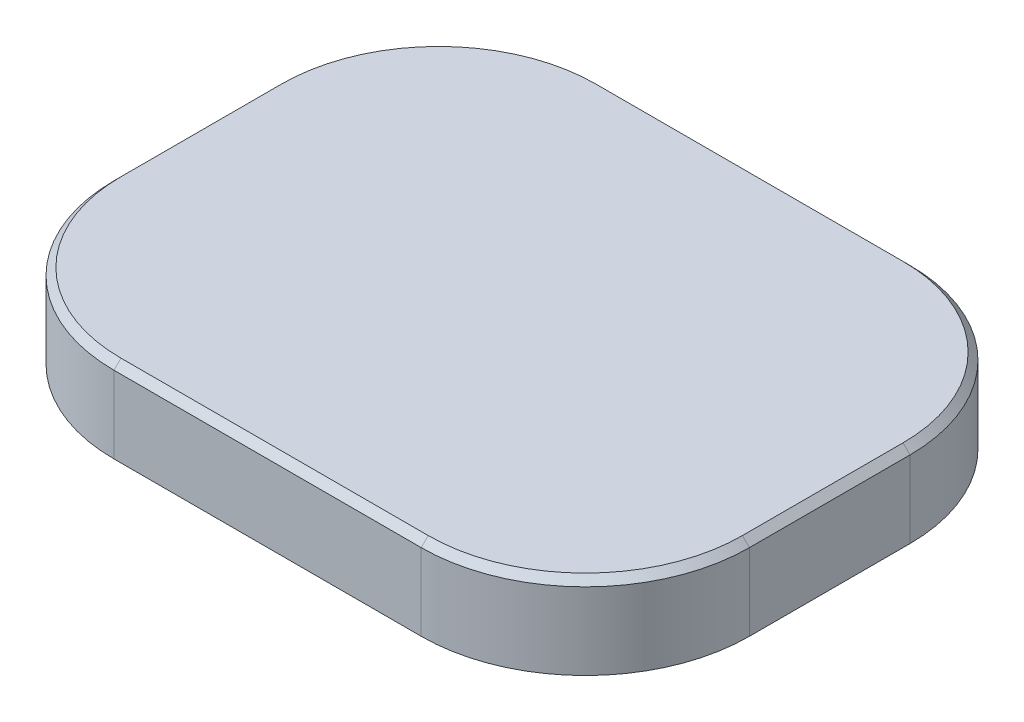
ISO-10303-21;
HEADER;
FILE_DESCRIPTION(('STEP AP214'),'2;1');
FILE_NAME('part.step','',(''),(''),'','','');
FILE_SCHEMA(('AUTOMOTIVE_DESIGN { 1 0 10303 214 1 1 1 1 }'));
ENDSEC;
DATA;
#1=APPLICATION_CONTEXT('core data for automotive mechanical design processes');
#2=APPLICATION_PROTOCOL_DEFINITION('international standard','automotive_design',2000,#1);
#3=PRODUCT_CONTEXT('',#1,'mechanical');
#4=PRODUCT('Part','Part','',(#3));
#5=PRODUCT_RELATED_PRODUCT_CATEGORY('part','',(#4));
#6=PRODUCT_DEFINITION_FORMATION('','',#4);
#7=PRODUCT_DEFINITION_CONTEXT('part definition',#1,'design');
#8=PRODUCT_DEFINITION('design','',#6,#7);
#9=PRODUCT_DEFINITION_SHAPE('','',#8);
#10=(LENGTH_UNIT() NAMED_UNIT(*) SI_UNIT(.MILLI.,.METRE.));
#11=(NAMED_UNIT(*) PLANE_ANGLE_UNIT() SI_UNIT($,.RADIAN.));
#12=(NAMED_UNIT(*) SI_UNIT($,.STERADIAN.) SOLID_ANGLE_UNIT());
#13=UNCERTAINTY_MEASURE_WITH_UNIT(LENGTH_MEASURE(1.E-05),#10,'distance_accuracy_value','');
#14=(GEOMETRIC_REPRESENTATION_CONTEXT(3) GLOBAL_UNCERTAINTY_ASSIGNED_CONTEXT((#13)) GLOBAL_UNIT_ASSIGNED_CONTEXT((#10,
#11,#12)) REPRESENTATION_CONTEXT('',''));
#15=CARTESIAN_POINT('',(0.,0.,0.));
#16=DIRECTION('',(0.,0.,1.));
#17=DIRECTION('',(1.,0.,0.));
#18=AXIS2_PLACEMENT_3D('',#15,#16,#17);
#19=CARTESIAN_POINT('',(0.,30.,0.));
#20=DIRECTION('',(0.,1.,0.));
#21=DIRECTION('',(0.,0.,1.));
#22=AXIS2_PLACEMENT_3D('',#19,#20,#21);
#23=PLANE('',#22);
#24=CARTESIAN_POINT('',(-22.,30.,-11.5));
#25=DIRECTION('',(0.,1.,0.));
#26=DIRECTION('',(0.,0.,1.));
#27=AXIS2_PLACEMENT_3D('',#24,#25,#26);
#28=CIRCLE('',#27,23.5);
#29=CARTESIAN_POINT('',(-22.,30.,-35.));
#30=VERTEX_POINT('',#29);
#31=CARTESIAN_POINT('',(-45.5,30.,-11.5));
#32=VERTEX_POINT('',#31);
#33=EDGE_CURVE('E364',#30,#32,#28,.T.);
#34=ORIENTED_EDGE('',*,*,#33,.F.);
#35=DIRECTION('',(-1.,0.,0.));
#36=VECTOR('',#35,1.);
#37=CARTESIAN_POINT('',(45.5,30.,-35.));
#38=LINE('',#37,#36);
#39=CARTESIAN_POINT('',(22.,30.,-35.));
#40=VERTEX_POINT('',#39);
#41=EDGE_CURVE('E371',#40,#30,#38,.T.);
#42=ORIENTED_EDGE('',*,*,#41,.F.);
#43=CARTESIAN_POINT('',(22.,30.,-11.5));
#44=DIRECTION('',(0.,1.,0.));
#45=DIRECTION('',(0.,0.,1.));
#46=AXIS2_PLACEMENT_3D('',#43,#44,#45);
#47=CIRCLE('',#46,23.5);
#48=CARTESIAN_POINT('',(45.5,30.,-11.5));
#49=VERTEX_POINT('',#48);
#50=EDGE_CURVE('E352',#49,#40,#47,.T.);
#51=ORIENTED_EDGE('',*,*,#50,.F.);
#52=DIRECTION('',(0.,0.,-1.));
#53=VECTOR('',#52,1.);
#54=CARTESIAN_POINT('',(45.5,30.,-35.));
#55=LINE('',#54,#53);
#56=CARTESIAN_POINT('',(45.5,30.,11.5));
#57=VERTEX_POINT('',#56);
#58=EDGE_CURVE('E374',#57,#49,#55,.T.);
#59=ORIENTED_EDGE('',*,*,#58,.F.);
#60=CARTESIAN_POINT('',(22.,30.,11.5));
#61=DIRECTION('',(0.,1.,0.));
#62=DIRECTION('',(0.,0.,1.));
#63=AXIS2_PLACEMENT_3D('',#60,#61,#62);
#64=CIRCLE('',#63,23.5);
#65=CARTESIAN_POINT('',(22.,30.,35.));
#66=VERTEX_POINT('',#65);
#67=EDGE_CURVE('E366',#66,#57,#64,.T.);
#68=ORIENTED_EDGE('',*,*,#67,.F.);
#69=DIRECTION('',(1.,0.,0.));
#70=VECTOR('',#69,1.);
#71=CARTESIAN_POINT('',(45.5,30.,35.));
#72=LINE('',#71,#70);
#73=CARTESIAN_POINT('',(-22.,30.,35.));
#74=VERTEX_POINT('',#73);
#75=EDGE_CURVE('E378',#74,#66,#72,.T.);
#76=ORIENTED_EDGE('',*,*,#75,.F.);
#77=CARTESIAN_POINT('',(-22.,30.,11.5));
#78=DIRECTION('',(0.,1.,0.));
#79=DIRECTION('',(0.,0.,1.));
#80=AXIS2_PLACEMENT_3D('',#77,#78,#79);
#81=CIRCLE('',#80,23.5);
#82=CARTESIAN_POINT('',(-45.5,30.,11.5));
#83=VERTEX_POINT('',#82);
#84=EDGE_CURVE('E368',#83,#74,#81,.T.);
#85=ORIENTED_EDGE('',*,*,#84,.F.);
#86=DIRECTION('',(0.,0.,1.));
#87=VECTOR('',#86,1.);
#88=CARTESIAN_POINT('',(-45.5,30.,-35.));
#89=LINE('',#88,#87);
#90=EDGE_CURVE('E381',#32,#83,#89,.T.);
#91=ORIENTED_EDGE('',*,*,#90,.F.);
#92=EDGE_LOOP('',(#34,#42,#51,#59,#68,#76,#85,#91));
#93=FACE_BOUND('',#92,.T.);
#94=CARTESIAN_POINT('',(22.,30.,11.5));
#95=DIRECTION('',(0.,-1.,0.));
#96=DIRECTION('',(0.,0.,-1.));
#97=AXIS2_PLACEMENT_3D('',#94,#95,#96);
#98=CIRCLE('',#97,19.9);
#99=CARTESIAN_POINT('',(41.9,30.,11.5));
#100=VERTEX_POINT('',#99);
#101=CARTESIAN_POINT('',(22.,30.,31.4));
#102=VERTEX_POINT('',#101);
#103=EDGE_CURVE('E288',#100,#102,#98,.T.);
#104=ORIENTED_EDGE('',*,*,#103,.F.);
#105=DIRECTION('',(0.,0.,1.));
#106=VECTOR('',#105,1.);
#107=CARTESIAN_POINT('',(41.9,30.,-11.5));
#108=LINE('',#107,#106);
#109=CARTESIAN_POINT('',(41.9,30.,-11.5));
#110=VERTEX_POINT('',#109);
#111=EDGE_CURVE('E293',#110,#100,#108,.T.);
#112=ORIENTED_EDGE('',*,*,#111,.F.);
#113=CARTESIAN_POINT('',(22.,30.,-11.5));
#114=DIRECTION('',(0.,-1.,0.));
#115=DIRECTION('',(0.,0.,-1.));
#116=AXIS2_PLACEMENT_3D('',#113,#114,#115);
#117=CIRCLE('',#116,19.9);
#118=CARTESIAN_POINT('',(22.,30.,-31.4));
#119=VERTEX_POINT('',#118);
#120=EDGE_CURVE('E321',#119,#110,#117,.T.);
#121=ORIENTED_EDGE('',*,*,#120,.F.);
#122=DIRECTION('',(1.,0.,0.));
#123=VECTOR('',#122,1.);
#124=CARTESIAN_POINT('',(-22.,30.,-31.4));
#125=LINE('',#124,#123);
#126=CARTESIAN_POINT('',(-22.,30.,-31.4));
#127=VERTEX_POINT('',#126);
#128=EDGE_CURVE('E318',#127,#119,#125,.T.);
#129=ORIENTED_EDGE('',*,*,#128,.F.);
#130=CARTESIAN_POINT('',(-22.,30.,-11.5));
#131=DIRECTION('',(0.,-1.,0.));
#132=DIRECTION('',(0.,0.,-1.));
#133=AXIS2_PLACEMENT_3D('',#130,#131,#132);
#134=CIRCLE('',#133,19.9);
#135=CARTESIAN_POINT('',(-41.9,30.,-11.5));
#136=VERTEX_POINT('',#135);
#137=EDGE_CURVE('E315',#136,#127,#134,.T.);
#138=ORIENTED_EDGE('',*,*,#137,.F.);
#139=DIRECTION('',(0.,0.,-1.));
#140=VECTOR('',#139,1.);
#141=CARTESIAN_POINT('',(-41.9,30.,11.5));
#142=LINE('',#141,#140);
#143=CARTESIAN_POINT('',(-41.9,30.,11.5));
#144=VERTEX_POINT('',#143);
#145=EDGE_CURVE('E312',#144,#136,#142,.T.);
#146=ORIENTED_EDGE('',*,*,#145,.F.);
#147=CARTESIAN_POINT('',(-22.,30.,11.5));
#148=DIRECTION('',(0.,-1.,0.));
#149=DIRECTION('',(0.,0.,-1.));
#150=AXIS2_PLACEMENT_3D('',#147,#148,#149);
#151=CIRCLE('',#150,19.9);
#152=CARTESIAN_POINT('',(-22.,30.,31.4));
#153=VERTEX_POINT('',#152);
#154=EDGE_CURVE('E58',#153,#144,#151,.T.);
#155=ORIENTED_EDGE('',*,*,#154,.F.);
#156=DIRECTION('',(-1.,0.,0.));
#157=VECTOR('',#156,1.);
#158=CARTESIAN_POINT('',(22.,30.,31.4));
#159=LINE('',#158,#157);
#160=EDGE_CURVE('E53',#102,#153,#159,.T.);
#161=ORIENTED_EDGE('',*,*,#160,.F.);
#162=EDGE_LOOP('',(#104,#112,#121,#129,#138,#146,#155,#161));
#163=FACE_BOUND('',#162,.T.);
#164=ADVANCED_FACE('F36',(#93,#163),#23,.F.);
#165=CARTESIAN_POINT('',(45.5,42.,35.));
#166=DIRECTION('',(0.,0.,-1.));
#167=DIRECTION('',(-1.,0.,0.));
#168=AXIS2_PLACEMENT_3D('',#165,#166,#167);
#169=PLANE('',#168);
#170=DIRECTION('',(0.,1.,0.));
#171=VECTOR('',#170,1.);
#172=CARTESIAN_POINT('',(22.,22.,35.));
#173=LINE('',#172,#171);
#174=CARTESIAN_POINT('',(22.,41.,35.));
#175=VERTEX_POINT('',#174);
#176=EDGE_CURVE('E356',#66,#175,#173,.T.);
#177=ORIENTED_EDGE('',*,*,#176,.T.);
#178=DIRECTION('',(-1.,0.,0.));
#179=VECTOR('',#178,1.);
#180=CARTESIAN_POINT('',(45.5,41.,35.));
#181=LINE('',#180,#179);
#182=CARTESIAN_POINT('',(-22.,41.,35.));
#183=VERTEX_POINT('',#182);
#184=EDGE_CURVE('E426',#175,#183,#181,.T.);
#185=ORIENTED_EDGE('',*,*,#184,.T.);
#186=DIRECTION('',(0.,1.,0.));
#187=VECTOR('',#186,1.);
#188=CARTESIAN_POINT('',(-22.,22.,35.));
#189=LINE('',#188,#187);
#190=EDGE_CURVE('E359',#74,#183,#189,.T.);
#191=ORIENTED_EDGE('',*,*,#190,.F.);
#192=ORIENTED_EDGE('',*,*,#75,.T.);
#193=EDGE_LOOP('',(#177,#185,#191,#192));
#194=FACE_BOUND('',#193,.T.);
#195=ADVANCED_FACE('F552',(#194),#169,.F.);
#196=CARTESIAN_POINT('',(0.,42.,0.));
#197=DIRECTION('',(0.,-1.,0.));
#198=DIRECTION('',(0.,0.,-1.));
#199=AXIS2_PLACEMENT_3D('',#196,#197,#198);
#200=PLANE('',#199);
#201=DIRECTION('',(-1.,0.,0.));
#202=VECTOR('',#201,1.);
#203=CARTESIAN_POINT('',(0.,42.,-34.));
#204=LINE('',#203,#202);
#205=CARTESIAN_POINT('',(22.,42.,-34.));
#206=VERTEX_POINT('',#205);
#207=CARTESIAN_POINT('',(-22.,42.,-34.));
#208=VERTEX_POINT('',#207);
#209=EDGE_CURVE('E408',#206,#208,#204,.T.);
#210=ORIENTED_EDGE('',*,*,#209,.T.);
#211=CARTESIAN_POINT('',(-22.,42.,-11.5));
#212=DIRECTION('',(0.,-1.,0.));
#213=DIRECTION('',(0.,0.,-1.));
#214=AXIS2_PLACEMENT_3D('',#211,#212,#213);
#215=CIRCLE('',#214,22.5);
#216=CARTESIAN_POINT('',(-44.5,42.,-11.5));
#217=VERTEX_POINT('',#216);
#218=EDGE_CURVE('E412',#208,#217,#215,.F.);
#219=ORIENTED_EDGE('',*,*,#218,.T.);
#220=DIRECTION('',(0.,0.,1.));
#221=VECTOR('',#220,1.);
#222=CARTESIAN_POINT('',(-44.5,42.,0.));
#223=LINE('',#222,#221);
#224=CARTESIAN_POINT('',(-44.5,42.,11.5));
#225=VERTEX_POINT('',#224);
#226=EDGE_CURVE('E410',#217,#225,#223,.T.);
#227=ORIENTED_EDGE('',*,*,#226,.T.);
#228=CARTESIAN_POINT('',(-22.,42.,11.5));
#229=DIRECTION('',(0.,-1.,0.));
#230=DIRECTION('',(0.,0.,-1.));
#231=AXIS2_PLACEMENT_3D('',#228,#229,#230);
#232=CIRCLE('',#231,22.5);
#233=CARTESIAN_POINT('',(-22.,42.,34.));
#234=VERTEX_POINT('',#233);
#235=EDGE_CURVE('E406',#225,#234,#232,.F.);
#236=ORIENTED_EDGE('',*,*,#235,.T.);
#237=DIRECTION('',(1.,0.,0.));
#238=VECTOR('',#237,1.);
#239=CARTESIAN_POINT('',(0.,42.,34.));
#240=LINE('',#239,#238);
#241=CARTESIAN_POINT('',(22.,42.,34.));
#242=VERTEX_POINT('',#241);
#243=EDGE_CURVE('E402',#234,#242,#240,.T.);
#244=ORIENTED_EDGE('',*,*,#243,.T.);
#245=CARTESIAN_POINT('',(22.,42.,11.5));
#246=DIRECTION('',(0.,-1.,0.));
#247=DIRECTION('',(0.,0.,-1.));
#248=AXIS2_PLACEMENT_3D('',#245,#246,#247);
#249=CIRCLE('',#248,22.5);
#250=CARTESIAN_POINT('',(44.5000000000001,42.,11.5));
#251=VERTEX_POINT('',#250);
#252=EDGE_CURVE('E398',#242,#251,#249,.F.);
#253=ORIENTED_EDGE('',*,*,#252,.T.);
#254=DIRECTION('',(0.,0.,-1.));
#255=VECTOR('',#254,1.);
#256=CARTESIAN_POINT('',(44.5,42.,0.));
#257=LINE('',#256,#255);
#258=CARTESIAN_POINT('',(44.5,42.,-11.5));
#259=VERTEX_POINT('',#258);
#260=EDGE_CURVE('E400',#251,#259,#257,.T.);
#261=ORIENTED_EDGE('',*,*,#260,.T.);
#262=CARTESIAN_POINT('',(22.,42.,-11.5));
#263=DIRECTION('',(0.,-1.,0.));
#264=DIRECTION('',(0.,0.,-1.));
#265=AXIS2_PLACEMENT_3D('',#262,#263,#264);
#266=CIRCLE('',#265,22.5);
#267=EDGE_CURVE('E404',#259,#206,#266,.F.);
#268=ORIENTED_EDGE('',*,*,#267,.T.);
#269=EDGE_LOOP('',(#210,#219,#227,#236,#244,#253,#261,#268));
#270=FACE_BOUND('',#269,.T.);
#271=ADVANCED_FACE('F558',(#270),#200,.F.);
#272=CARTESIAN_POINT('',(-45.5,42.,-35.));
#273=DIRECTION('',(1.,0.,0.));
#274=DIRECTION('',(0.,0.,-1.));
#275=AXIS2_PLACEMENT_3D('',#272,#273,#274);
#276=PLANE('',#275);
#277=DIRECTION('',(0.,1.,0.));
#278=VECTOR('',#277,1.);
#279=CARTESIAN_POINT('',(-45.5,22.,11.5));
#280=LINE('',#279,#278);
#281=CARTESIAN_POINT('',(-45.5,41.,11.5));
#282=VERTEX_POINT('',#281);
#283=EDGE_CURVE('E395',#83,#282,#280,.T.);
#284=ORIENTED_EDGE('',*,*,#283,.T.);
#285=DIRECTION('',(0.,0.,-1.));
#286=VECTOR('',#285,1.);
#287=CARTESIAN_POINT('',(-45.5,41.,-35.));
#288=LINE('',#287,#286);
#289=CARTESIAN_POINT('',(-45.5,41.,-11.5));
#290=VERTEX_POINT('',#289);
#291=EDGE_CURVE('E418',#282,#290,#288,.T.);
#292=ORIENTED_EDGE('',*,*,#291,.T.);
#293=DIRECTION('',(0.,1.,0.));
#294=VECTOR('',#293,1.);
#295=CARTESIAN_POINT('',(-45.5,22.,-11.5));
#296=LINE('',#295,#294);
#297=EDGE_CURVE('E349',#32,#290,#296,.T.);
#298=ORIENTED_EDGE('',*,*,#297,.F.);
#299=ORIENTED_EDGE('',*,*,#90,.T.);
#300=EDGE_LOOP('',(#284,#292,#298,#299));
#301=FACE_BOUND('',#300,.T.);
#302=ADVANCED_FACE('F564',(#301),#276,.F.);
#303=CARTESIAN_POINT('',(45.5,42.,-35.));
#304=DIRECTION('',(-1.,0.,0.));
#305=DIRECTION('',(0.,0.,1.));
#306=AXIS2_PLACEMENT_3D('',#303,#304,#305);
#307=PLANE('',#306);
#308=DIRECTION('',(0.,1.,0.));
#309=VECTOR('',#308,1.);
#310=CARTESIAN_POINT('',(45.5,22.,-11.5));
#311=LINE('',#310,#309);
#312=CARTESIAN_POINT('',(45.5,41.,-11.5));
#313=VERTEX_POINT('',#312);
#314=EDGE_CURVE('E353',#49,#313,#311,.T.);
#315=ORIENTED_EDGE('',*,*,#314,.T.);
#316=DIRECTION('',(0.,0.,1.));
#317=VECTOR('',#316,1.);
#318=CARTESIAN_POINT('',(45.5,41.,-35.));
#319=LINE('',#318,#317);
#320=CARTESIAN_POINT('',(45.5,41.,11.5));
#321=VERTEX_POINT('',#320);
#322=EDGE_CURVE('E45',#313,#321,#319,.T.);
#323=ORIENTED_EDGE('',*,*,#322,.T.);
#324=DIRECTION('',(0.,1.,0.));
#325=VECTOR('',#324,1.);
#326=CARTESIAN_POINT('',(45.5,22.,11.5));
#327=LINE('',#326,#325);
#328=EDGE_CURVE('E392',#57,#321,#327,.T.);
#329=ORIENTED_EDGE('',*,*,#328,.F.);
#330=ORIENTED_EDGE('',*,*,#58,.T.);
#331=EDGE_LOOP('',(#315,#323,#329,#330));
#332=FACE_BOUND('',#331,.T.);
#333=ADVANCED_FACE('F828',(#332),#307,.F.);
#334=CARTESIAN_POINT('',(45.5,42.,-35.));
#335=DIRECTION('',(0.,0.,1.));
#336=DIRECTION('',(1.,0.,0.));
#337=AXIS2_PLACEMENT_3D('',#334,#335,#336);
#338=PLANE('',#337);
#339=DIRECTION('',(0.,1.,0.));
#340=VECTOR('',#339,1.);
#341=CARTESIAN_POINT('',(-22.,22.,-35.));
#342=LINE('',#341,#340);
#343=CARTESIAN_POINT('',(-22.,41.,-35.));
#344=VERTEX_POINT('',#343);
#345=EDGE_CURVE('E388',#30,#344,#342,.T.);
#346=ORIENTED_EDGE('',*,*,#345,.T.);
#347=DIRECTION('',(1.,0.,0.));
#348=VECTOR('',#347,1.);
#349=CARTESIAN_POINT('',(45.5,41.,-35.));
#350=LINE('',#349,#348);
#351=CARTESIAN_POINT('',(22.,41.,-35.));
#352=VERTEX_POINT('',#351);
#353=EDGE_CURVE('E420',#344,#352,#350,.T.);
#354=ORIENTED_EDGE('',*,*,#353,.T.);
#355=DIRECTION('',(0.,1.,0.));
#356=VECTOR('',#355,1.);
#357=CARTESIAN_POINT('',(22.,22.,-35.));
#358=LINE('',#357,#356);
#359=EDGE_CURVE('E385',#40,#352,#358,.T.);
#360=ORIENTED_EDGE('',*,*,#359,.F.);
#361=ORIENTED_EDGE('',*,*,#41,.T.);
#362=EDGE_LOOP('',(#346,#354,#360,#361));
#363=FACE_BOUND('',#362,.T.);
#364=ADVANCED_FACE('F822',(#363),#338,.F.);
#365=CARTESIAN_POINT('',(22.,22.,-11.5));
#366=DIRECTION('',(0.,1.,0.));
#367=DIRECTION('',(0.,0.,1.));
#368=AXIS2_PLACEMENT_3D('',#365,#366,#367);
#369=CYLINDRICAL_SURFACE('',#368,23.5);
#370=ORIENTED_EDGE('',*,*,#359,.T.);
#371=CARTESIAN_POINT('',(22.,41.,-11.5));
#372=DIRECTION('',(0.,-1.,0.));
#373=DIRECTION('',(0.,0.,-1.));
#374=AXIS2_PLACEMENT_3D('',#371,#372,#373);
#375=CIRCLE('',#374,23.5);
#376=EDGE_CURVE('E424',#352,#313,#375,.T.);
#377=ORIENTED_EDGE('',*,*,#376,.T.);
#378=ORIENTED_EDGE('',*,*,#314,.F.);
#379=ORIENTED_EDGE('',*,*,#50,.T.);
#380=EDGE_LOOP('',(#370,#377,#378,#379));
#381=FACE_BOUND('',#380,.T.);
#382=ADVANCED_FACE('F827',(#381),#369,.T.);
#383=CARTESIAN_POINT('',(-22.,22.,-11.5));
#384=DIRECTION('',(0.,1.,0.));
#385=DIRECTION('',(0.,0.,1.));
#386=AXIS2_PLACEMENT_3D('',#383,#384,#385);
#387=CYLINDRICAL_SURFACE('',#386,23.5);
#388=ORIENTED_EDGE('',*,*,#297,.T.);
#389=CARTESIAN_POINT('',(-22.,41.,-11.5));
#390=DIRECTION('',(0.,-1.,0.));
#391=DIRECTION('',(0.,0.,-1.));
#392=AXIS2_PLACEMENT_3D('',#389,#390,#391);
#393=CIRCLE('',#392,23.5);
#394=EDGE_CURVE('E415',#290,#344,#393,.T.);
#395=ORIENTED_EDGE('',*,*,#394,.T.);
#396=ORIENTED_EDGE('',*,*,#345,.F.);
#397=ORIENTED_EDGE('',*,*,#33,.T.);
#398=EDGE_LOOP('',(#388,#395,#396,#397));
#399=FACE_BOUND('',#398,.T.);
#400=ADVANCED_FACE('F859',(#399),#387,.T.);
#401=CARTESIAN_POINT('',(22.,22.,11.5));
#402=DIRECTION('',(0.,1.,0.));
#403=DIRECTION('',(0.,0.,1.));
#404=AXIS2_PLACEMENT_3D('',#401,#402,#403);
#405=CYLINDRICAL_SURFACE('',#404,23.5);
#406=ORIENTED_EDGE('',*,*,#328,.T.);
#407=CARTESIAN_POINT('',(22.,41.,11.5));
#408=DIRECTION('',(0.,-1.,0.));
#409=DIRECTION('',(0.,0.,-1.));
#410=AXIS2_PLACEMENT_3D('',#407,#408,#409);
#411=CIRCLE('',#410,23.5);
#412=EDGE_CURVE('E11',#321,#175,#411,.T.);
#413=ORIENTED_EDGE('',*,*,#412,.T.);
#414=ORIENTED_EDGE('',*,*,#176,.F.);
#415=ORIENTED_EDGE('',*,*,#67,.T.);
#416=EDGE_LOOP('',(#406,#413,#414,#415));
#417=FACE_BOUND('',#416,.T.);
#418=ADVANCED_FACE('F868',(#417),#405,.T.);
#419=CARTESIAN_POINT('',(-22.,22.,11.5));
#420=DIRECTION('',(0.,1.,0.));
#421=DIRECTION('',(0.,0.,1.));
#422=AXIS2_PLACEMENT_3D('',#419,#420,#421);
#423=CYLINDRICAL_SURFACE('',#422,23.5);
#424=ORIENTED_EDGE('',*,*,#190,.T.);
#425=CARTESIAN_POINT('',(-22.,41.,11.5));
#426=DIRECTION('',(0.,-1.,0.));
#427=DIRECTION('',(0.,0.,-1.));
#428=AXIS2_PLACEMENT_3D('',#425,#426,#427);
#429=CIRCLE('',#428,23.5);
#430=EDGE_CURVE('E422',#183,#282,#429,.T.);
#431=ORIENTED_EDGE('',*,*,#430,.T.);
#432=ORIENTED_EDGE('',*,*,#283,.F.);
#433=ORIENTED_EDGE('',*,*,#84,.T.);
#434=EDGE_LOOP('',(#424,#431,#432,#433));
#435=FACE_BOUND('',#434,.T.);
#436=ADVANCED_FACE('F596',(#435),#423,.T.);
#437=CARTESIAN_POINT('',(22.,42.,11.5));
#438=DIRECTION('',(0.,-1.,0.));
#439=DIRECTION('',(0.,0.,-1.));
#440=AXIS2_PLACEMENT_3D('',#437,#438,#439);
#441=CONICAL_SURFACE('',#440,22.5,0.785398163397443);
#442=DIRECTION('',(0.,0.70710678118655,-0.707106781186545));
#443=VECTOR('',#442,1.);
#444=CARTESIAN_POINT('',(22.,41.,35.));
#445=LINE('',#444,#443);
#446=EDGE_CURVE('E444',#175,#242,#445,.T.);
#447=ORIENTED_EDGE('',*,*,#446,.F.);
#448=ORIENTED_EDGE('',*,*,#412,.F.);
#449=DIRECTION('',(0.707106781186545,-0.70710678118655,0.));
#450=VECTOR('',#449,1.);
#451=CARTESIAN_POINT('',(44.5000000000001,42.,11.5));
#452=LINE('',#451,#450);
#453=EDGE_CURVE('E362',#251,#321,#452,.T.);
#454=ORIENTED_EDGE('',*,*,#453,.F.);
#455=ORIENTED_EDGE('',*,*,#252,.F.);
#456=EDGE_LOOP('',(#447,#448,#454,#455));
#457=FACE_BOUND('',#456,.T.);
#458=ADVANCED_FACE('F592',(#457),#441,.T.);
#459=CARTESIAN_POINT('',(44.5,42.,0.));
#460=DIRECTION('',(-0.70710678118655,-0.707106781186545,0.));
#461=DIRECTION('',(0.,0.,-1.));
#462=AXIS2_PLACEMENT_3D('',#459,#460,#461);
#463=PLANE('',#462);
#464=ORIENTED_EDGE('',*,*,#453,.T.);
#465=ORIENTED_EDGE('',*,*,#322,.F.);
#466=DIRECTION('',(0.707106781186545,-0.70710678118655,0.));
#467=VECTOR('',#466,1.);
#468=CARTESIAN_POINT('',(44.5,42.,-11.5));
#469=LINE('',#468,#467);
#470=EDGE_CURVE('E441',#259,#313,#469,.T.);
#471=ORIENTED_EDGE('',*,*,#470,.F.);
#472=ORIENTED_EDGE('',*,*,#260,.F.);
#473=EDGE_LOOP('',(#464,#465,#471,#472));
#474=FACE_BOUND('',#473,.T.);
#475=ADVANCED_FACE('F588',(#474),#463,.F.);
#476=CARTESIAN_POINT('',(0.,42.,34.));
#477=DIRECTION('',(0.,-0.707106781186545,-0.70710678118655));
#478=DIRECTION('',(1.,0.,0.));
#479=AXIS2_PLACEMENT_3D('',#476,#477,#478);
#480=PLANE('',#479);
#481=ORIENTED_EDGE('',*,*,#446,.T.);
#482=ORIENTED_EDGE('',*,*,#243,.F.);
#483=DIRECTION('',(0.,0.707106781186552,-0.707106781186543));
#484=VECTOR('',#483,1.);
#485=CARTESIAN_POINT('',(-22.,41.,35.));
#486=LINE('',#485,#484);
#487=EDGE_CURVE('E438',#183,#234,#486,.T.);
#488=ORIENTED_EDGE('',*,*,#487,.F.);
#489=ORIENTED_EDGE('',*,*,#184,.F.);
#490=EDGE_LOOP('',(#481,#482,#488,#489));
#491=FACE_BOUND('',#490,.T.);
#492=ADVANCED_FACE('F584',(#491),#480,.F.);
#493=CARTESIAN_POINT('',(22.,42.,-11.5));
#494=DIRECTION('',(0.,-1.,0.));
#495=DIRECTION('',(0.,0.,-1.));
#496=AXIS2_PLACEMENT_3D('',#493,#494,#495);
#497=CONICAL_SURFACE('',#496,22.5,0.785398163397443);
#498=ORIENTED_EDGE('',*,*,#470,.T.);
#499=ORIENTED_EDGE('',*,*,#376,.F.);
#500=DIRECTION('',(0.,-0.707106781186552,-0.707106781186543));
#501=VECTOR('',#500,1.);
#502=CARTESIAN_POINT('',(22.,42.,-34.));
#503=LINE('',#502,#501);
#504=EDGE_CURVE('E435',#206,#352,#503,.T.);
#505=ORIENTED_EDGE('',*,*,#504,.F.);
#506=ORIENTED_EDGE('',*,*,#267,.F.);
#507=EDGE_LOOP('',(#498,#499,#505,#506));
#508=FACE_BOUND('',#507,.T.);
#509=ADVANCED_FACE('F580',(#508),#497,.T.);
#510=CARTESIAN_POINT('',(-22.,42.,11.5));
#511=DIRECTION('',(0.,-1.,0.));
#512=DIRECTION('',(0.,0.,-1.));
#513=AXIS2_PLACEMENT_3D('',#510,#511,#512);
#514=CONICAL_SURFACE('',#513,22.5,0.785398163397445);
#515=ORIENTED_EDGE('',*,*,#487,.T.);
#516=ORIENTED_EDGE('',*,*,#235,.F.);
#517=DIRECTION('',(0.707106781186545,0.70710678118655,0.));
#518=VECTOR('',#517,1.);
#519=CARTESIAN_POINT('',(-45.5,41.,11.5));
#520=LINE('',#519,#518);
#521=EDGE_CURVE('E432',#282,#225,#520,.T.);
#522=ORIENTED_EDGE('',*,*,#521,.F.);
#523=ORIENTED_EDGE('',*,*,#430,.F.);
#524=EDGE_LOOP('',(#515,#516,#522,#523));
#525=FACE_BOUND('',#524,.T.);
#526=ADVANCED_FACE('F576',(#525),#514,.T.);
#527=CARTESIAN_POINT('',(0.,42.,-34.));
#528=DIRECTION('',(0.,-0.707106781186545,0.70710678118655));
#529=DIRECTION('',(-1.,0.,0.));
#530=AXIS2_PLACEMENT_3D('',#527,#528,#529);
#531=PLANE('',#530);
#532=ORIENTED_EDGE('',*,*,#504,.T.);
#533=ORIENTED_EDGE('',*,*,#353,.F.);
#534=DIRECTION('',(0.,-0.70710678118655,-0.707106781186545));
#535=VECTOR('',#534,1.);
#536=CARTESIAN_POINT('',(-22.,42.,-34.));
#537=LINE('',#536,#535);
#538=EDGE_CURVE('E430',#208,#344,#537,.T.);
#539=ORIENTED_EDGE('',*,*,#538,.F.);
#540=ORIENTED_EDGE('',*,*,#209,.F.);
#541=EDGE_LOOP('',(#532,#533,#539,#540));
#542=FACE_BOUND('',#541,.T.);
#543=ADVANCED_FACE('F572',(#542),#531,.F.);
#544=CARTESIAN_POINT('',(-44.5,42.,0.));
#545=DIRECTION('',(0.70710678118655,-0.707106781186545,0.));
#546=DIRECTION('',(0.,0.,1.));
#547=AXIS2_PLACEMENT_3D('',#544,#545,#546);
#548=PLANE('',#547);
#549=ORIENTED_EDGE('',*,*,#521,.T.);
#550=ORIENTED_EDGE('',*,*,#226,.F.);
#551=DIRECTION('',(0.707106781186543,0.707106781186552,0.));
#552=VECTOR('',#551,1.);
#553=CARTESIAN_POINT('',(-45.5,41.,-11.5));
#554=LINE('',#553,#552);
#555=EDGE_CURVE('E348',#290,#217,#554,.T.);
#556=ORIENTED_EDGE('',*,*,#555,.F.);
#557=ORIENTED_EDGE('',*,*,#291,.F.);
#558=EDGE_LOOP('',(#549,#550,#556,#557));
#559=FACE_BOUND('',#558,.T.);
#560=ADVANCED_FACE('F568',(#559),#548,.F.);
#561=CARTESIAN_POINT('',(-22.,42.,-11.5));
#562=DIRECTION('',(0.,-1.,0.));
#563=DIRECTION('',(0.,0.,-1.));
#564=AXIS2_PLACEMENT_3D('',#561,#562,#563);
#565=CONICAL_SURFACE('',#564,22.5,0.785398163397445);
#566=ORIENTED_EDGE('',*,*,#538,.T.);
#567=ORIENTED_EDGE('',*,*,#394,.F.);
#568=ORIENTED_EDGE('',*,*,#555,.T.);
#569=ORIENTED_EDGE('',*,*,#218,.F.);
#570=EDGE_LOOP('',(#566,#567,#568,#569));
#571=FACE_BOUND('',#570,.T.);
#572=ADVANCED_FACE('F565',(#571),#565,.T.);
#573=CARTESIAN_POINT('',(22.,29.,11.5));
#574=DIRECTION('',(0.,-1.,0.));
#575=DIRECTION('',(0.,0.,-1.));
#576=AXIS2_PLACEMENT_3D('',#573,#574,#575);
#577=PLANE('',#576);
#578=CARTESIAN_POINT('',(22.,29.,11.5));
#579=DIRECTION('',(0.,-1.,0.));
#580=DIRECTION('',(0.,0.,-1.));
#581=AXIS2_PLACEMENT_3D('',#578,#579,#580);
#582=CIRCLE('',#581,19.9);
#583=CARTESIAN_POINT('',(41.9,29.,11.5));
#584=VERTEX_POINT('',#583);
#585=CARTESIAN_POINT('',(22.,29.,31.4));
#586=VERTEX_POINT('',#585);
#587=EDGE_CURVE('E289',#584,#586,#582,.T.);
#588=ORIENTED_EDGE('',*,*,#587,.T.);
#589=DIRECTION('',(-1.,0.,0.));
#590=VECTOR('',#589,1.);
#591=CARTESIAN_POINT('',(22.,29.,31.4));
#592=LINE('',#591,#590);
#593=CARTESIAN_POINT('',(-22.,29.,31.4));
#594=VERTEX_POINT('',#593);
#595=EDGE_CURVE('E292',#586,#594,#592,.T.);
#596=ORIENTED_EDGE('',*,*,#595,.T.);
#597=CARTESIAN_POINT('',(-22.,29.,11.5));
#598=DIRECTION('',(0.,-1.,0.));
#599=DIRECTION('',(0.,0.,-1.));
#600=AXIS2_PLACEMENT_3D('',#597,#598,#599);
#601=CIRCLE('',#600,19.9);
#602=CARTESIAN_POINT('',(-41.9,29.,11.5));
#603=VERTEX_POINT('',#602);
#604=EDGE_CURVE('E295',#594,#603,#601,.T.);
#605=ORIENTED_EDGE('',*,*,#604,.T.);
#606=DIRECTION('',(0.,0.,-1.));
#607=VECTOR('',#606,1.);
#608=CARTESIAN_POINT('',(-41.9,29.,11.5));
#609=LINE('',#608,#607);
#610=CARTESIAN_POINT('',(-41.9,29.,-11.5));
#611=VERTEX_POINT('',#610);
#612=EDGE_CURVE('E297',#603,#611,#609,.T.);
#613=ORIENTED_EDGE('',*,*,#612,.T.);
#614=CARTESIAN_POINT('',(-22.,29.,-11.5));
#615=DIRECTION('',(0.,-1.,0.));
#616=DIRECTION('',(0.,0.,-1.));
#617=AXIS2_PLACEMENT_3D('',#614,#615,#616);
#618=CIRCLE('',#617,19.9);
#619=CARTESIAN_POINT('',(-22.,29.,-31.4));
#620=VERTEX_POINT('',#619);
#621=EDGE_CURVE('E299',#611,#620,#618,.T.);
#622=ORIENTED_EDGE('',*,*,#621,.T.);
#623=DIRECTION('',(1.,0.,0.));
#624=VECTOR('',#623,1.);
#625=CARTESIAN_POINT('',(-22.,29.,-31.4));
#626=LINE('',#625,#624);
#627=CARTESIAN_POINT('',(22.,29.,-31.4));
#628=VERTEX_POINT('',#627);
#629=EDGE_CURVE('E301',#620,#628,#626,.T.);
#630=ORIENTED_EDGE('',*,*,#629,.T.);
#631=CARTESIAN_POINT('',(22.,29.,-11.5));
#632=DIRECTION('',(0.,-1.,0.));
#633=DIRECTION('',(0.,0.,-1.));
#634=AXIS2_PLACEMENT_3D('',#631,#632,#633);
#635=CIRCLE('',#634,19.9);
#636=CARTESIAN_POINT('',(41.9,29.,-11.5));
#637=VERTEX_POINT('',#636);
#638=EDGE_CURVE('E303',#628,#637,#635,.T.);
#639=ORIENTED_EDGE('',*,*,#638,.T.);
#640=DIRECTION('',(0.,0.,1.));
#641=VECTOR('',#640,1.);
#642=CARTESIAN_POINT('',(41.9,29.,-11.5));
#643=LINE('',#642,#641);
#644=EDGE_CURVE('E305',#637,#584,#643,.T.);
#645=ORIENTED_EDGE('',*,*,#644,.T.);
#646=EDGE_LOOP('',(#588,#596,#605,#613,#622,#630,#639,#645));
#647=FACE_BOUND('',#646,.T.);
#648=DIRECTION('',(0.,0.,-1.));
#649=VECTOR('',#648,1.);
#650=CARTESIAN_POINT('',(-41.3,29.,11.5));
#651=LINE('',#650,#649);
#652=CARTESIAN_POINT('',(-41.3,29.,11.5));
#653=VERTEX_POINT('',#652);
#654=CARTESIAN_POINT('',(-41.3,29.,-11.5));
#655=VERTEX_POINT('',#654);
#656=EDGE_CURVE('E249',#653,#655,#651,.T.);
#657=ORIENTED_EDGE('',*,*,#656,.F.);
#658=CARTESIAN_POINT('',(-22.,29.,11.5));
#659=DIRECTION('',(0.,-1.,0.));
#660=DIRECTION('',(0.,0.,-1.));
#661=AXIS2_PLACEMENT_3D('',#658,#659,#660);
#662=CIRCLE('',#661,19.3);
#663=CARTESIAN_POINT('',(-22.,29.,30.8));
#664=VERTEX_POINT('',#663);
#665=EDGE_CURVE('E259',#664,#653,#662,.T.);
#666=ORIENTED_EDGE('',*,*,#665,.F.);
#667=DIRECTION('',(-1.,0.,0.));
#668=VECTOR('',#667,1.);
#669=CARTESIAN_POINT('',(22.,29.,30.8));
#670=LINE('',#669,#668);
#671=CARTESIAN_POINT('',(22.,29.,30.8));
#672=VERTEX_POINT('',#671);
#673=EDGE_CURVE('E286',#672,#664,#670,.T.);
#674=ORIENTED_EDGE('',*,*,#673,.F.);
#675=CARTESIAN_POINT('',(22.,29.,11.5));
#676=DIRECTION('',(0.,-1.,0.));
#677=DIRECTION('',(0.,0.,-1.));
#678=AXIS2_PLACEMENT_3D('',#675,#676,#677);
#679=CIRCLE('',#678,19.3);
#680=CARTESIAN_POINT('',(41.3,29.,11.5));
#681=VERTEX_POINT('',#680);
#682=EDGE_CURVE('E283',#681,#672,#679,.T.);
#683=ORIENTED_EDGE('',*,*,#682,.F.);
#684=DIRECTION('',(0.,0.,1.));
#685=VECTOR('',#684,1.);
#686=CARTESIAN_POINT('',(41.3,29.,-11.5));
#687=LINE('',#686,#685);
#688=CARTESIAN_POINT('',(41.3,29.,-11.5));
#689=VERTEX_POINT('',#688);
#690=EDGE_CURVE('E280',#689,#681,#687,.T.);
#691=ORIENTED_EDGE('',*,*,#690,.F.);
#692=CARTESIAN_POINT('',(22.,29.,-11.5));
#693=DIRECTION('',(0.,-1.,0.));
#694=DIRECTION('',(0.,0.,-1.));
#695=AXIS2_PLACEMENT_3D('',#692,#693,#694);
#696=CIRCLE('',#695,19.3);
#697=CARTESIAN_POINT('',(22.,29.,-30.8));
#698=VERTEX_POINT('',#697);
#699=EDGE_CURVE('E277',#698,#689,#696,.T.);
#700=ORIENTED_EDGE('',*,*,#699,.F.);
#701=DIRECTION('',(1.,0.,0.));
#702=VECTOR('',#701,1.);
#703=CARTESIAN_POINT('',(-22.,29.,-30.8));
#704=LINE('',#703,#702);
#705=CARTESIAN_POINT('',(-22.,29.,-30.8));
#706=VERTEX_POINT('',#705);
#707=EDGE_CURVE('E272',#706,#698,#704,.T.);
#708=ORIENTED_EDGE('',*,*,#707,.F.);
#709=CARTESIAN_POINT('',(-22.,29.,-11.5));
#710=DIRECTION('',(0.,-1.,0.));
#711=DIRECTION('',(0.,0.,-1.));
#712=AXIS2_PLACEMENT_3D('',#709,#710,#711);
#713=CIRCLE('',#712,19.3);
#714=EDGE_CURVE('E270',#655,#706,#713,.T.);
#715=ORIENTED_EDGE('',*,*,#714,.F.);
#716=EDGE_LOOP('',(#657,#666,#674,#683,#691,#700,#708,#715));
#717=FACE_BOUND('',#716,.T.);
#718=ADVANCED_FACE('F267',(#647,#717),#577,.T.);
#719=CARTESIAN_POINT('',(22.,29.,11.5));
#720=DIRECTION('',(0.,1.,0.));
#721=DIRECTION('',(0.,0.,1.));
#722=AXIS2_PLACEMENT_3D('',#719,#720,#721);
#723=CYLINDRICAL_SURFACE('',#722,19.9);
#724=ORIENTED_EDGE('',*,*,#103,.T.);
#725=DIRECTION('',(0.,1.,0.));
#726=VECTOR('',#725,1.);
#727=CARTESIAN_POINT('',(22.,29.,31.4));
#728=LINE('',#727,#726);
#729=EDGE_CURVE('E346',#586,#102,#728,.T.);
#730=ORIENTED_EDGE('',*,*,#729,.F.);
#731=ORIENTED_EDGE('',*,*,#587,.F.);
#732=DIRECTION('',(0.,1.,0.));
#733=VECTOR('',#732,1.);
#734=CARTESIAN_POINT('',(41.9,29.,11.5));
#735=LINE('',#734,#733);
#736=EDGE_CURVE('E307',#584,#100,#735,.T.);
#737=ORIENTED_EDGE('',*,*,#736,.T.);
#738=EDGE_LOOP('',(#724,#730,#731,#737));
#739=FACE_BOUND('',#738,.T.);
#740=ADVANCED_FACE('F891',(#739),#723,.T.);
#741=CARTESIAN_POINT('',(22.,29.,31.4));
#742=DIRECTION('',(0.,0.,-1.));
#743=DIRECTION('',(-1.,0.,0.));
#744=AXIS2_PLACEMENT_3D('',#741,#742,#743);
#745=PLANE('',#744);
#746=ORIENTED_EDGE('',*,*,#160,.T.);
#747=DIRECTION('',(0.,1.,0.));
#748=VECTOR('',#747,1.);
#749=CARTESIAN_POINT('',(-22.,29.,31.4));
#750=LINE('',#749,#748);
#751=EDGE_CURVE('E343',#594,#153,#750,.T.);
#752=ORIENTED_EDGE('',*,*,#751,.F.);
#753=ORIENTED_EDGE('',*,*,#595,.F.);
#754=ORIENTED_EDGE('',*,*,#729,.T.);
#755=EDGE_LOOP('',(#746,#752,#753,#754));
#756=FACE_BOUND('',#755,.T.);
#757=ADVANCED_FACE('F900',(#756),#745,.F.);
#758=CARTESIAN_POINT('',(-22.,29.,11.5));
#759=DIRECTION('',(0.,1.,0.));
#760=DIRECTION('',(0.,0.,1.));
#761=AXIS2_PLACEMENT_3D('',#758,#759,#760);
#762=CYLINDRICAL_SURFACE('',#761,19.9);
#763=ORIENTED_EDGE('',*,*,#154,.T.);
#764=DIRECTION('',(0.,1.,0.));
#765=VECTOR('',#764,1.);
#766=CARTESIAN_POINT('',(-41.9,29.,11.5));
#767=LINE('',#766,#765);
#768=EDGE_CURVE('E340',#603,#144,#767,.T.);
#769=ORIENTED_EDGE('',*,*,#768,.F.);
#770=ORIENTED_EDGE('',*,*,#604,.F.);
#771=ORIENTED_EDGE('',*,*,#751,.T.);
#772=EDGE_LOOP('',(#763,#769,#770,#771));
#773=FACE_BOUND('',#772,.T.);
#774=ADVANCED_FACE('F909',(#773),#762,.T.);
#775=CARTESIAN_POINT('',(-41.9,29.,11.5));
#776=DIRECTION('',(1.,0.,0.));
#777=DIRECTION('',(0.,0.,-1.));
#778=AXIS2_PLACEMENT_3D('',#775,#776,#777);
#779=PLANE('',#778);
#780=ORIENTED_EDGE('',*,*,#145,.T.);
#781=DIRECTION('',(0.,1.,0.));
#782=VECTOR('',#781,1.);
#783=CARTESIAN_POINT('',(-41.9,29.,-11.5));
#784=LINE('',#783,#782);
#785=EDGE_CURVE('E337',#611,#136,#784,.T.);
#786=ORIENTED_EDGE('',*,*,#785,.F.);
#787=ORIENTED_EDGE('',*,*,#612,.F.);
#788=ORIENTED_EDGE('',*,*,#768,.T.);
#789=EDGE_LOOP('',(#780,#786,#787,#788));
#790=FACE_BOUND('',#789,.T.);
#791=ADVANCED_FACE('F918',(#790),#779,.F.);
#792=CARTESIAN_POINT('',(-22.,29.,-11.5));
#793=DIRECTION('',(0.,1.,0.));
#794=DIRECTION('',(0.,0.,1.));
#795=AXIS2_PLACEMENT_3D('',#792,#793,#794);
#796=CYLINDRICAL_SURFACE('',#795,19.9);
#797=ORIENTED_EDGE('',*,*,#137,.T.);
#798=DIRECTION('',(0.,1.,0.));
#799=VECTOR('',#798,1.);
#800=CARTESIAN_POINT('',(-22.,29.,-31.4));
#801=LINE('',#800,#799);
#802=EDGE_CURVE('E334',#620,#127,#801,.T.);
#803=ORIENTED_EDGE('',*,*,#802,.F.);
#804=ORIENTED_EDGE('',*,*,#621,.F.);
#805=ORIENTED_EDGE('',*,*,#785,.T.);
#806=EDGE_LOOP('',(#797,#803,#804,#805));
#807=FACE_BOUND('',#806,.T.);
#808=ADVANCED_FACE('F927',(#807),#796,.T.);
#809=CARTESIAN_POINT('',(-22.,29.,-31.4));
#810=DIRECTION('',(0.,0.,1.));
#811=DIRECTION('',(1.,0.,0.));
#812=AXIS2_PLACEMENT_3D('',#809,#810,#811);
#813=PLANE('',#812);
#814=ORIENTED_EDGE('',*,*,#128,.T.);
#815=DIRECTION('',(0.,1.,0.));
#816=VECTOR('',#815,1.);
#817=CARTESIAN_POINT('',(22.,29.,-31.4));
#818=LINE('',#817,#816);
#819=EDGE_CURVE('E331',#628,#119,#818,.T.);
#820=ORIENTED_EDGE('',*,*,#819,.F.);
#821=ORIENTED_EDGE('',*,*,#629,.F.);
#822=ORIENTED_EDGE('',*,*,#802,.T.);
#823=EDGE_LOOP('',(#814,#820,#821,#822));
#824=FACE_BOUND('',#823,.T.);
#825=ADVANCED_FACE('F936',(#824),#813,.F.);
#826=CARTESIAN_POINT('',(22.,29.,-11.5));
#827=DIRECTION('',(0.,1.,0.));
#828=DIRECTION('',(0.,0.,1.));
#829=AXIS2_PLACEMENT_3D('',#826,#827,#828);
#830=CYLINDRICAL_SURFACE('',#829,19.9);
#831=ORIENTED_EDGE('',*,*,#120,.T.);
#832=DIRECTION('',(0.,1.,0.));
#833=VECTOR('',#832,1.);
#834=CARTESIAN_POINT('',(41.9,29.,-11.5));
#835=LINE('',#834,#833);
#836=EDGE_CURVE('E328',#637,#110,#835,.T.);
#837=ORIENTED_EDGE('',*,*,#836,.F.);
#838=ORIENTED_EDGE('',*,*,#638,.F.);
#839=ORIENTED_EDGE('',*,*,#819,.T.);
#840=EDGE_LOOP('',(#831,#837,#838,#839));
#841=FACE_BOUND('',#840,.T.);
#842=ADVANCED_FACE('F945',(#841),#830,.T.);
#843=CARTESIAN_POINT('',(41.9,29.,-11.5));
#844=DIRECTION('',(-1.,0.,0.));
#845=DIRECTION('',(0.,0.,1.));
#846=AXIS2_PLACEMENT_3D('',#843,#844,#845);
#847=PLANE('',#846);
#848=ORIENTED_EDGE('',*,*,#111,.T.);
#849=ORIENTED_EDGE('',*,*,#736,.F.);
#850=ORIENTED_EDGE('',*,*,#644,.F.);
#851=ORIENTED_EDGE('',*,*,#836,.T.);
#852=EDGE_LOOP('',(#848,#849,#850,#851));
#853=FACE_BOUND('',#852,.T.);
#854=ADVANCED_FACE('F813',(#853),#847,.F.);
#855=CARTESIAN_POINT('',(0.,37.8,0.));
#856=DIRECTION('',(0.,-1.,0.));
#857=DIRECTION('',(0.,0.,-1.));
#858=AXIS2_PLACEMENT_3D('',#855,#856,#857);
#859=PLANE('',#858);
#860=CARTESIAN_POINT('',(22.,37.8,-11.5));
#861=DIRECTION('',(0.,-1.,0.));
#862=DIRECTION('',(0.,0.,-1.));
#863=AXIS2_PLACEMENT_3D('',#860,#861,#862);
#864=CIRCLE('',#863,14.);
#865=CARTESIAN_POINT('',(22.,37.8,-25.5));
#866=VERTEX_POINT('',#865);
#867=CARTESIAN_POINT('',(36.,37.8,-11.5));
#868=VERTEX_POINT('',#867);
#869=EDGE_CURVE('E470',#866,#868,#864,.T.);
#870=ORIENTED_EDGE('',*,*,#869,.T.);
#871=DIRECTION('',(0.,0.,-1.));
#872=VECTOR('',#871,1.);
#873=CARTESIAN_POINT('',(36.,37.8,0.));
#874=LINE('',#873,#872);
#875=CARTESIAN_POINT('',(36.,37.8,11.5));
#876=VERTEX_POINT('',#875);
#877=EDGE_CURVE('E474',#868,#876,#874,.F.);
#878=ORIENTED_EDGE('',*,*,#877,.T.);
#879=CARTESIAN_POINT('',(22.,37.8,11.5));
#880=DIRECTION('',(0.,-1.,0.));
#881=DIRECTION('',(0.,0.,-1.));
#882=AXIS2_PLACEMENT_3D('',#879,#880,#881);
#883=CIRCLE('',#882,14.);
#884=CARTESIAN_POINT('',(22.,37.8,25.5));
#885=VERTEX_POINT('',#884);
#886=EDGE_CURVE('E481',#876,#885,#883,.T.);
#887=ORIENTED_EDGE('',*,*,#886,.T.);
#888=DIRECTION('',(1.,0.,0.));
#889=VECTOR('',#888,1.);
#890=CARTESIAN_POINT('',(0.,37.8,25.5));
#891=LINE('',#890,#889);
#892=CARTESIAN_POINT('',(-22.,37.8,25.5));
#893=VERTEX_POINT('',#892);
#894=EDGE_CURVE('E491',#885,#893,#891,.F.);
#895=ORIENTED_EDGE('',*,*,#894,.T.);
#896=CARTESIAN_POINT('',(-22.,37.8,11.5));
#897=DIRECTION('',(0.,-1.,0.));
#898=DIRECTION('',(0.,0.,-1.));
#899=AXIS2_PLACEMENT_3D('',#896,#897,#898);
#900=CIRCLE('',#899,14.);
#901=CARTESIAN_POINT('',(-36.,37.8,11.5));
#902=VERTEX_POINT('',#901);
#903=EDGE_CURVE('E498',#893,#902,#900,.T.);
#904=ORIENTED_EDGE('',*,*,#903,.T.);
#905=DIRECTION('',(0.,0.,-1.));
#906=VECTOR('',#905,1.);
#907=CARTESIAN_POINT('',(-36.,37.8,0.));
#908=LINE('',#907,#906);
#909=CARTESIAN_POINT('',(-36.,37.8,-11.5));
#910=VERTEX_POINT('',#909);
#911=EDGE_CURVE('E500',#902,#910,#908,.T.);
#912=ORIENTED_EDGE('',*,*,#911,.T.);
#913=CARTESIAN_POINT('',(-22.,37.8,-11.5));
#914=DIRECTION('',(0.,-1.,0.));
#915=DIRECTION('',(0.,0.,-1.));
#916=AXIS2_PLACEMENT_3D('',#913,#914,#915);
#917=CIRCLE('',#916,14.);
#918=CARTESIAN_POINT('',(-22.,37.8,-25.5));
#919=VERTEX_POINT('',#918);
#920=EDGE_CURVE('E471',#910,#919,#917,.T.);
#921=ORIENTED_EDGE('',*,*,#920,.T.);
#922=DIRECTION('',(1.,0.,0.));
#923=VECTOR('',#922,1.);
#924=CARTESIAN_POINT('',(0.,37.8,-25.5));
#925=LINE('',#924,#923);
#926=EDGE_CURVE('E468',#919,#866,#925,.T.);
#927=ORIENTED_EDGE('',*,*,#926,.T.);
#928=EDGE_LOOP('',(#870,#878,#887,#895,#904,#912,#921,#927));
#929=FACE_BOUND('',#928,.T.);
#930=ADVANCED_FACE('F519',(#929),#859,.T.);
#931=CARTESIAN_POINT('',(45.5,32.5,25.5));
#932=DIRECTION('',(-1.,0.,0.));
#933=DIRECTION('',(0.,0.,1.));
#934=AXIS2_PLACEMENT_3D('',#931,#932,#933);
#935=CYLINDRICAL_SURFACE('',#934,5.3);
#936=CARTESIAN_POINT('',(-22.,32.5,25.5));
#937=DIRECTION('',(-1.,0.,0.));
#938=DIRECTION('',(0.,0.,1.));
#939=AXIS2_PLACEMENT_3D('',#936,#937,#938);
#940=CIRCLE('',#939,5.3);
#941=CARTESIAN_POINT('',(-22.,32.5,30.8));
#942=VERTEX_POINT('',#941);
#943=EDGE_CURVE('E462',#942,#893,#940,.T.);
#944=ORIENTED_EDGE('',*,*,#943,.T.);
#945=ORIENTED_EDGE('',*,*,#894,.F.);
#946=CARTESIAN_POINT('',(22.,32.5,25.5));
#947=DIRECTION('',(1.,0.,0.));
#948=DIRECTION('',(0.,0.,-1.));
#949=AXIS2_PLACEMENT_3D('',#946,#947,#948);
#950=CIRCLE('',#949,5.3);
#951=CARTESIAN_POINT('',(22.,32.5,30.8));
#952=VERTEX_POINT('',#951);
#953=EDGE_CURVE('E463',#952,#885,#950,.F.);
#954=ORIENTED_EDGE('',*,*,#953,.F.);
#955=DIRECTION('',(-1.,0.,0.));
#956=VECTOR('',#955,1.);
#957=CARTESIAN_POINT('',(45.5,32.5,30.8));
#958=LINE('',#957,#956);
#959=EDGE_CURVE('E487',#942,#952,#958,.F.);
#960=ORIENTED_EDGE('',*,*,#959,.F.);
#961=EDGE_LOOP('',(#944,#945,#954,#960));
#962=FACE_BOUND('',#961,.T.);
#963=ADVANCED_FACE('F525',(#962),#935,.F.);
#964=CARTESIAN_POINT('',(36.,32.5,-35.));
#965=DIRECTION('',(0.,0.,1.));
#966=DIRECTION('',(1.,0.,0.));
#967=AXIS2_PLACEMENT_3D('',#964,#965,#966);
#968=CYLINDRICAL_SURFACE('',#967,5.3);
#969=CARTESIAN_POINT('',(36.,32.5,11.5));
#970=DIRECTION('',(0.,0.,1.));
#971=DIRECTION('',(1.,0.,0.));
#972=AXIS2_PLACEMENT_3D('',#969,#970,#971);
#973=CIRCLE('',#972,5.3);
#974=CARTESIAN_POINT('',(41.3,32.5,11.5));
#975=VERTEX_POINT('',#974);
#976=EDGE_CURVE('E467',#975,#876,#973,.T.);
#977=ORIENTED_EDGE('',*,*,#976,.T.);
#978=ORIENTED_EDGE('',*,*,#877,.F.);
#979=CARTESIAN_POINT('',(36.,32.5,-11.5));
#980=DIRECTION('',(0.,0.,1.));
#981=DIRECTION('',(1.,0.,0.));
#982=AXIS2_PLACEMENT_3D('',#979,#980,#981);
#983=CIRCLE('',#982,5.3);
#984=CARTESIAN_POINT('',(41.3,32.5,-11.5));
#985=VERTEX_POINT('',#984);
#986=EDGE_CURVE('E370',#868,#985,#983,.F.);
#987=ORIENTED_EDGE('',*,*,#986,.T.);
#988=DIRECTION('',(0.,0.,1.));
#989=VECTOR('',#988,1.);
#990=CARTESIAN_POINT('',(41.3,32.5,-35.));
#991=LINE('',#990,#989);
#992=EDGE_CURVE('E384',#975,#985,#991,.F.);
#993=ORIENTED_EDGE('',*,*,#992,.F.);
#994=EDGE_LOOP('',(#977,#978,#987,#993));
#995=FACE_BOUND('',#994,.T.);
#996=ADVANCED_FACE('F614',(#995),#968,.F.);
#997=CARTESIAN_POINT('',(22.,32.5,11.5));
#998=DIRECTION('',(0.,-1.,0.));
#999=DIRECTION('',(0.,0.,-1.));
#1000=AXIS2_PLACEMENT_3D('',#997,#998,#999);
#1001=TOROIDAL_SURFACE('',#1000,14.,5.3);
#1002=ORIENTED_EDGE('',*,*,#953,.T.);
#1003=ORIENTED_EDGE('',*,*,#886,.F.);
#1004=ORIENTED_EDGE('',*,*,#976,.F.);
#1005=CARTESIAN_POINT('',(22.,32.5,11.5));
#1006=DIRECTION('',(0.,1.,0.));
#1007=DIRECTION('',(0.,0.,1.));
#1008=AXIS2_PLACEMENT_3D('',#1005,#1006,#1007);
#1009=CIRCLE('',#1008,19.3);
#1010=EDGE_CURVE('E389',#952,#975,#1009,.T.);
#1011=ORIENTED_EDGE('',*,*,#1010,.F.);
#1012=EDGE_LOOP('',(#1002,#1003,#1004,#1011));
#1013=FACE_BOUND('',#1012,.T.);
#1014=ADVANCED_FACE('F529',(#1013),#1001,.F.);
#1015=CARTESIAN_POINT('',(45.5,32.5,-25.5));
#1016=DIRECTION('',(1.,0.,0.));
#1017=DIRECTION('',(0.,0.,-1.));
#1018=AXIS2_PLACEMENT_3D('',#1015,#1016,#1017);
#1019=CYLINDRICAL_SURFACE('',#1018,5.3);
#1020=CARTESIAN_POINT('',(-22.,32.5,-25.5));
#1021=DIRECTION('',(1.,0.,0.));
#1022=DIRECTION('',(0.,0.,-1.));
#1023=AXIS2_PLACEMENT_3D('',#1020,#1021,#1022);
#1024=CIRCLE('',#1023,5.3);
#1025=CARTESIAN_POINT('',(-22.,32.5,-30.8));
#1026=VERTEX_POINT('',#1025);
#1027=EDGE_CURVE('E459',#919,#1026,#1024,.F.);
#1028=ORIENTED_EDGE('',*,*,#1027,.T.);
#1029=DIRECTION('',(1.,0.,0.));
#1030=VECTOR('',#1029,1.);
#1031=CARTESIAN_POINT('',(45.5,32.5,-30.8));
#1032=LINE('',#1031,#1030);
#1033=CARTESIAN_POINT('',(22.,32.5,-30.8));
#1034=VERTEX_POINT('',#1033);
#1035=EDGE_CURVE('E453',#1034,#1026,#1032,.F.);
#1036=ORIENTED_EDGE('',*,*,#1035,.F.);
#1037=CARTESIAN_POINT('',(22.,32.5,-25.5));
#1038=DIRECTION('',(-1.,0.,0.));
#1039=DIRECTION('',(0.,0.,1.));
#1040=AXIS2_PLACEMENT_3D('',#1037,#1038,#1039);
#1041=CIRCLE('',#1040,5.3);
#1042=EDGE_CURVE('E464',#866,#1034,#1041,.T.);
#1043=ORIENTED_EDGE('',*,*,#1042,.F.);
#1044=ORIENTED_EDGE('',*,*,#926,.F.);
#1045=EDGE_LOOP('',(#1028,#1036,#1043,#1044));
#1046=FACE_BOUND('',#1045,.T.);
#1047=ADVANCED_FACE('F603',(#1046),#1019,.F.);
#1048=CARTESIAN_POINT('',(22.,32.5,-11.5));
#1049=DIRECTION('',(0.,-1.,0.));
#1050=DIRECTION('',(0.,0.,-1.));
#1051=AXIS2_PLACEMENT_3D('',#1048,#1049,#1050);
#1052=TOROIDAL_SURFACE('',#1051,14.,5.3);
#1053=ORIENTED_EDGE('',*,*,#1042,.T.);
#1054=CARTESIAN_POINT('',(22.,32.5,-11.5));
#1055=DIRECTION('',(0.,1.,0.));
#1056=DIRECTION('',(0.,0.,1.));
#1057=AXIS2_PLACEMENT_3D('',#1054,#1055,#1056);
#1058=CIRCLE('',#1057,19.3);
#1059=EDGE_CURVE('E456',#985,#1034,#1058,.T.);
#1060=ORIENTED_EDGE('',*,*,#1059,.F.);
#1061=ORIENTED_EDGE('',*,*,#986,.F.);
#1062=ORIENTED_EDGE('',*,*,#869,.F.);
#1063=EDGE_LOOP('',(#1053,#1060,#1061,#1062));
#1064=FACE_BOUND('',#1063,.T.);
#1065=ADVANCED_FACE('F606',(#1064),#1052,.F.);
#1066=CARTESIAN_POINT('',(-36.,32.5,-35.));
#1067=DIRECTION('',(0.,0.,-1.));
#1068=DIRECTION('',(-1.,0.,0.));
#1069=AXIS2_PLACEMENT_3D('',#1066,#1067,#1068);
#1070=CYLINDRICAL_SURFACE('',#1069,5.3);
#1071=CARTESIAN_POINT('',(-36.,32.5,-11.5));
#1072=DIRECTION('',(0.,0.,1.));
#1073=DIRECTION('',(1.,0.,0.));
#1074=AXIS2_PLACEMENT_3D('',#1071,#1072,#1073);
#1075=CIRCLE('',#1074,5.3);
#1076=CARTESIAN_POINT('',(-41.3,32.5,-11.5));
#1077=VERTEX_POINT('',#1076);
#1078=EDGE_CURVE('E496',#910,#1077,#1075,.T.);
#1079=ORIENTED_EDGE('',*,*,#1078,.F.);
#1080=ORIENTED_EDGE('',*,*,#911,.F.);
#1081=CARTESIAN_POINT('',(-36.,32.5,11.5));
#1082=DIRECTION('',(0.,0.,1.));
#1083=DIRECTION('',(1.,0.,0.));
#1084=AXIS2_PLACEMENT_3D('',#1081,#1082,#1083);
#1085=CIRCLE('',#1084,5.3);
#1086=CARTESIAN_POINT('',(-41.3,32.5,11.5));
#1087=VERTEX_POINT('',#1086);
#1088=EDGE_CURVE('E505',#1087,#902,#1085,.F.);
#1089=ORIENTED_EDGE('',*,*,#1088,.F.);
#1090=DIRECTION('',(0.,0.,-1.));
#1091=VECTOR('',#1090,1.);
#1092=CARTESIAN_POINT('',(-41.3,32.5,-35.));
#1093=LINE('',#1092,#1091);
#1094=EDGE_CURVE('E252',#1077,#1087,#1093,.F.);
#1095=ORIENTED_EDGE('',*,*,#1094,.F.);
#1096=EDGE_LOOP('',(#1079,#1080,#1089,#1095));
#1097=FACE_BOUND('',#1096,.T.);
#1098=ADVANCED_FACE('F516',(#1097),#1070,.F.);
#1099=CARTESIAN_POINT('',(-22.,32.5,-11.5));
#1100=DIRECTION('',(0.,-1.,0.));
#1101=DIRECTION('',(0.,0.,-1.));
#1102=AXIS2_PLACEMENT_3D('',#1099,#1100,#1101);
#1103=TOROIDAL_SURFACE('',#1102,14.,5.3);
#1104=ORIENTED_EDGE('',*,*,#1078,.T.);
#1105=CARTESIAN_POINT('',(-22.,32.5,-11.5));
#1106=DIRECTION('',(0.,1.,0.));
#1107=DIRECTION('',(0.,0.,1.));
#1108=AXIS2_PLACEMENT_3D('',#1105,#1106,#1107);
#1109=CIRCLE('',#1108,19.3);
#1110=EDGE_CURVE('E455',#1026,#1077,#1109,.T.);
#1111=ORIENTED_EDGE('',*,*,#1110,.F.);
#1112=ORIENTED_EDGE('',*,*,#1027,.F.);
#1113=ORIENTED_EDGE('',*,*,#920,.F.);
#1114=EDGE_LOOP('',(#1104,#1111,#1112,#1113));
#1115=FACE_BOUND('',#1114,.T.);
#1116=ADVANCED_FACE('F642',(#1115),#1103,.F.);
#1117=CARTESIAN_POINT('',(-22.,32.5,11.5));
#1118=DIRECTION('',(0.,-1.,0.));
#1119=DIRECTION('',(0.,0.,-1.));
#1120=AXIS2_PLACEMENT_3D('',#1117,#1118,#1119);
#1121=TOROIDAL_SURFACE('',#1120,14.,5.3);
#1122=ORIENTED_EDGE('',*,*,#1088,.T.);
#1123=ORIENTED_EDGE('',*,*,#903,.F.);
#1124=ORIENTED_EDGE('',*,*,#943,.F.);
#1125=CARTESIAN_POINT('',(-22.,32.5,11.5));
#1126=DIRECTION('',(0.,1.,0.));
#1127=DIRECTION('',(0.,0.,1.));
#1128=AXIS2_PLACEMENT_3D('',#1125,#1126,#1127);
#1129=CIRCLE('',#1128,19.3);
#1130=EDGE_CURVE('E40',#1087,#942,#1129,.T.);
#1131=ORIENTED_EDGE('',*,*,#1130,.F.);
#1132=EDGE_LOOP('',(#1122,#1123,#1124,#1131));
#1133=FACE_BOUND('',#1132,.T.);
#1134=ADVANCED_FACE('F38',(#1133),#1121,.F.);
#1135=CARTESIAN_POINT('',(-22.,42.,11.5));
#1136=DIRECTION('',(0.,1.,0.));
#1137=DIRECTION('',(0.,0.,1.));
#1138=AXIS2_PLACEMENT_3D('',#1135,#1136,#1137);
#1139=CYLINDRICAL_SURFACE('',#1138,19.3);
#1140=DIRECTION('',(0.,1.,0.));
#1141=VECTOR('',#1140,1.);
#1142=CARTESIAN_POINT('',(-41.3,42.,11.5));
#1143=LINE('',#1142,#1141);
#1144=EDGE_CURVE('E244',#1087,#653,#1143,.F.);
#1145=ORIENTED_EDGE('',*,*,#1144,.F.);
#1146=ORIENTED_EDGE('',*,*,#1130,.T.);
#1147=DIRECTION('',(0.,1.,0.));
#1148=VECTOR('',#1147,1.);
#1149=CARTESIAN_POINT('',(-22.,42.,30.8));
#1150=LINE('',#1149,#1148);
#1151=EDGE_CURVE('E262',#664,#942,#1150,.T.);
#1152=ORIENTED_EDGE('',*,*,#1151,.F.);
#1153=ORIENTED_EDGE('',*,*,#665,.T.);
#1154=EDGE_LOOP('',(#1145,#1146,#1152,#1153));
#1155=FACE_BOUND('',#1154,.T.);
#1156=ADVANCED_FACE('F260',(#1155),#1139,.F.);
#1157=CARTESIAN_POINT('',(-22.,42.,-11.5));
#1158=DIRECTION('',(0.,1.,0.));
#1159=DIRECTION('',(0.,0.,1.));
#1160=AXIS2_PLACEMENT_3D('',#1157,#1158,#1159);
#1161=CYLINDRICAL_SURFACE('',#1160,19.3);
#1162=DIRECTION('',(0.,1.,0.));
#1163=VECTOR('',#1162,1.);
#1164=CARTESIAN_POINT('',(-22.,42.,-30.8));
#1165=LINE('',#1164,#1163);
#1166=EDGE_CURVE('E452',#1026,#706,#1165,.F.);
#1167=ORIENTED_EDGE('',*,*,#1166,.F.);
#1168=ORIENTED_EDGE('',*,*,#1110,.T.);
#1169=DIRECTION('',(0.,1.,0.));
#1170=VECTOR('',#1169,1.);
#1171=CARTESIAN_POINT('',(-41.3,42.,-11.5));
#1172=LINE('',#1171,#1170);
#1173=EDGE_CURVE('E256',#655,#1077,#1172,.T.);
#1174=ORIENTED_EDGE('',*,*,#1173,.F.);
#1175=ORIENTED_EDGE('',*,*,#714,.T.);
#1176=EDGE_LOOP('',(#1167,#1168,#1174,#1175));
#1177=FACE_BOUND('',#1176,.T.);
#1178=ADVANCED_FACE('F665',(#1177),#1161,.F.);
#1179=CARTESIAN_POINT('',(-41.3,42.,-35.));
#1180=DIRECTION('',(1.,0.,0.));
#1181=DIRECTION('',(0.,0.,-1.));
#1182=AXIS2_PLACEMENT_3D('',#1179,#1180,#1181);
#1183=PLANE('',#1182);
#1184=ORIENTED_EDGE('',*,*,#1173,.T.);
#1185=ORIENTED_EDGE('',*,*,#1094,.T.);
#1186=ORIENTED_EDGE('',*,*,#1144,.T.);
#1187=ORIENTED_EDGE('',*,*,#656,.T.);
#1188=EDGE_LOOP('',(#1184,#1185,#1186,#1187));
#1189=FACE_BOUND('',#1188,.T.);
#1190=ADVANCED_FACE('F247',(#1189),#1183,.T.);
#1191=CARTESIAN_POINT('',(22.,42.,-11.5));
#1192=DIRECTION('',(0.,1.,0.));
#1193=DIRECTION('',(0.,0.,1.));
#1194=AXIS2_PLACEMENT_3D('',#1191,#1192,#1193);
#1195=CYLINDRICAL_SURFACE('',#1194,19.3);
#1196=DIRECTION('',(0.,1.,0.));
#1197=VECTOR('',#1196,1.);
#1198=CARTESIAN_POINT('',(41.3,42.,-11.5));
#1199=LINE('',#1198,#1197);
#1200=EDGE_CURVE('E375',#985,#689,#1199,.F.);
#1201=ORIENTED_EDGE('',*,*,#1200,.F.);
#1202=ORIENTED_EDGE('',*,*,#1059,.T.);
#1203=DIRECTION('',(0.,1.,0.));
#1204=VECTOR('',#1203,1.);
#1205=CARTESIAN_POINT('',(22.,42.,-30.8));
#1206=LINE('',#1205,#1204);
#1207=EDGE_CURVE('E449',#698,#1034,#1206,.T.);
#1208=ORIENTED_EDGE('',*,*,#1207,.F.);
#1209=ORIENTED_EDGE('',*,*,#699,.T.);
#1210=EDGE_LOOP('',(#1201,#1202,#1208,#1209));
#1211=FACE_BOUND('',#1210,.T.);
#1212=ADVANCED_FACE('F601',(#1211),#1195,.F.);
#1213=CARTESIAN_POINT('',(45.5,42.,-30.8));
#1214=DIRECTION('',(0.,0.,1.));
#1215=DIRECTION('',(1.,0.,0.));
#1216=AXIS2_PLACEMENT_3D('',#1213,#1214,#1215);
#1217=PLANE('',#1216);
#1218=ORIENTED_EDGE('',*,*,#1207,.T.);
#1219=ORIENTED_EDGE('',*,*,#1035,.T.);
#1220=ORIENTED_EDGE('',*,*,#1166,.T.);
#1221=ORIENTED_EDGE('',*,*,#707,.T.);
#1222=EDGE_LOOP('',(#1218,#1219,#1220,#1221));
#1223=FACE_BOUND('',#1222,.T.);
#1224=ADVANCED_FACE('F598',(#1223),#1217,.T.);
#1225=CARTESIAN_POINT('',(22.,42.,11.5));
#1226=DIRECTION('',(0.,1.,0.));
#1227=DIRECTION('',(0.,0.,1.));
#1228=AXIS2_PLACEMENT_3D('',#1225,#1226,#1227);
#1229=CYLINDRICAL_SURFACE('',#1228,19.3);
#1230=DIRECTION('',(0.,1.,0.));
#1231=VECTOR('',#1230,1.);
#1232=CARTESIAN_POINT('',(22.,42.,30.8));
#1233=LINE('',#1232,#1231);
#1234=EDGE_CURVE('E255',#952,#672,#1233,.F.);
#1235=ORIENTED_EDGE('',*,*,#1234,.F.);
#1236=ORIENTED_EDGE('',*,*,#1010,.T.);
#1237=DIRECTION('',(0.,1.,0.));
#1238=VECTOR('',#1237,1.);
#1239=CARTESIAN_POINT('',(41.3,42.,11.5));
#1240=LINE('',#1239,#1238);
#1241=EDGE_CURVE('E458',#681,#975,#1240,.T.);
#1242=ORIENTED_EDGE('',*,*,#1241,.F.);
#1243=ORIENTED_EDGE('',*,*,#682,.T.);
#1244=EDGE_LOOP('',(#1235,#1236,#1242,#1243));
#1245=FACE_BOUND('',#1244,.T.);
#1246=ADVANCED_FACE('F534',(#1245),#1229,.F.);
#1247=CARTESIAN_POINT('',(41.3,42.,-35.));
#1248=DIRECTION('',(-1.,0.,0.));
#1249=DIRECTION('',(0.,0.,1.));
#1250=AXIS2_PLACEMENT_3D('',#1247,#1248,#1249);
#1251=PLANE('',#1250);
#1252=ORIENTED_EDGE('',*,*,#1241,.T.);
#1253=ORIENTED_EDGE('',*,*,#992,.T.);
#1254=ORIENTED_EDGE('',*,*,#1200,.T.);
#1255=ORIENTED_EDGE('',*,*,#690,.T.);
#1256=EDGE_LOOP('',(#1252,#1253,#1254,#1255));
#1257=FACE_BOUND('',#1256,.T.);
#1258=ADVANCED_FACE('F536',(#1257),#1251,.T.);
#1259=CARTESIAN_POINT('',(45.5,42.,30.8));
#1260=DIRECTION('',(0.,0.,-1.));
#1261=DIRECTION('',(-1.,0.,0.));
#1262=AXIS2_PLACEMENT_3D('',#1259,#1260,#1261);
#1263=PLANE('',#1262);
#1264=ORIENTED_EDGE('',*,*,#1151,.T.);
#1265=ORIENTED_EDGE('',*,*,#959,.T.);
#1266=ORIENTED_EDGE('',*,*,#1234,.T.);
#1267=ORIENTED_EDGE('',*,*,#673,.T.);
#1268=EDGE_LOOP('',(#1264,#1265,#1266,#1267));
#1269=FACE_BOUND('',#1268,.T.);
#1270=ADVANCED_FACE('F542',(#1269),#1263,.T.);
#1271=CLOSED_SHELL('',(#164,#195,#271,#302,#333,#364,#382,#400,#418,#436,#458,#475,#492,#509,
#526,#543,#560,#572,#718,#740,#757,#774,#791,#808,#825,#842,#854,#930,#963,#996,#1014,#1047,
#1065,#1098,#1116,#1134,#1156,#1178,#1190,#1212,#1224,#1246,#1258,#1270));
#1272=MANIFOLD_SOLID_BREP('B2',#1271);
#1273=ADVANCED_BREP_SHAPE_REPRESENTATION('',(#18,#1272),#14);
#1274=SHAPE_DEFINITION_REPRESENTATION(#9,#1273);
ENDSEC;
END-ISO-10303-21;
